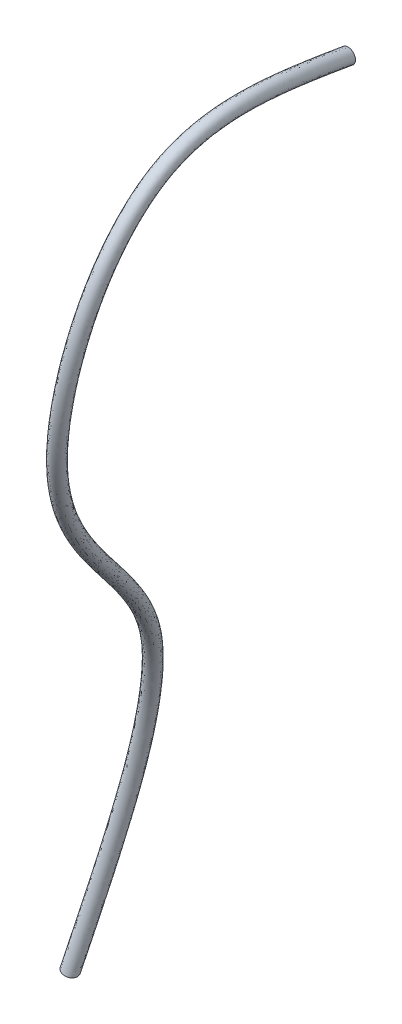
ISO-10303-21;
HEADER;
FILE_DESCRIPTION(('STEP AP214'),'2;1');
FILE_NAME('part.step','',(''),(''),'','','');
FILE_SCHEMA(('AUTOMOTIVE_DESIGN { 1 0 10303 214 1 1 1 1 }'));
ENDSEC;
DATA;
#1=APPLICATION_CONTEXT('core data for automotive mechanical design processes');
#2=APPLICATION_PROTOCOL_DEFINITION('international standard','automotive_design',2000,#1);
#3=PRODUCT_CONTEXT('',#1,'mechanical');
#4=PRODUCT('Part','Part','',(#3));
#5=PRODUCT_RELATED_PRODUCT_CATEGORY('part','',(#4));
#6=PRODUCT_DEFINITION_FORMATION('','',#4);
#7=PRODUCT_DEFINITION_CONTEXT('part definition',#1,'design');
#8=PRODUCT_DEFINITION('design','',#6,#7);
#9=PRODUCT_DEFINITION_SHAPE('','',#8);
#10=(LENGTH_UNIT() NAMED_UNIT(*) SI_UNIT(.MILLI.,.METRE.));
#11=(NAMED_UNIT(*) PLANE_ANGLE_UNIT() SI_UNIT($,.RADIAN.));
#12=(NAMED_UNIT(*) SI_UNIT($,.STERADIAN.) SOLID_ANGLE_UNIT());
#13=UNCERTAINTY_MEASURE_WITH_UNIT(LENGTH_MEASURE(1.E-05),#10,'distance_accuracy_value','');
#14=(GEOMETRIC_REPRESENTATION_CONTEXT(3) GLOBAL_UNCERTAINTY_ASSIGNED_CONTEXT((#13)) GLOBAL_UNIT_ASSIGNED_CONTEXT((#10,
#11,#12)) REPRESENTATION_CONTEXT('',''));
#15=CARTESIAN_POINT('',(0.,0.,0.));
#16=DIRECTION('',(0.,0.,1.));
#17=DIRECTION('',(1.,0.,0.));
#18=AXIS2_PLACEMENT_3D('',#15,#16,#17);
#19=CARTESIAN_POINT('',(-33.945147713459,-110.401100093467,4.85698409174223));
#20=DIRECTION('',(-0.282386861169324,-0.959298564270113,-0.00198121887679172));
#21=DIRECTION('',(0.947950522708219,-0.27872841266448,-0.153948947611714));
#22=AXIS2_PLACEMENT_3D('',#19,#20,#21);
#23=PLANE('',#22);
#24=CARTESIAN_POINT('',(-33.945147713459,-110.401100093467,4.85698409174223));
#25=DIRECTION('',(-0.282386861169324,-0.959298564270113,-0.00198121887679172));
#26=DIRECTION('',(0.947950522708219,-0.27872841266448,-0.153948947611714));
#27=AXIS2_PLACEMENT_3D('',#24,#25,#26);
#28=CIRCLE('',#27,0.609599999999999);
#29=CARTESIAN_POINT('',(-34.5291918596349,-110.229113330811,4.82656783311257));
#30=VERTEX_POINT('',#29);
#31=CARTESIAN_POINT('',(-34.4927669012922,-110.240340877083,5.07118460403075));
#32=VERTEX_POINT('',#31);
#33=EDGE_CURVE('E63',#30,#32,#28,.T.);
#34=ORIENTED_EDGE('',*,*,#33,.T.);
#35=DIRECTION('',(-0.147130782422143,0.0453512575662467,-0.988076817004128));
#36=VECTOR('',#35,1.);
#37=CARTESIAN_POINT('',(-34.4927669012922,-110.240340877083,5.07118460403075));
#38=LINE('',#37,#36);
#39=EDGE_CURVE('E65',#32,#30,#38,.T.);
#40=ORIENTED_EDGE('',*,*,#39,.T.);
#41=EDGE_LOOP('',(#34,#40));
#42=FACE_BOUND('',#41,.T.);
#43=ADVANCED_FACE('F28',(#42),#23,.T.);
#44=CARTESIAN_POINT('',(-16.0909,-39.1414,0.));
#45=DIRECTION('',(0.,0.,1.));
#46=DIRECTION('',(1.,0.,0.));
#47=AXIS2_PLACEMENT_3D('',#44,#45,#46);
#48=PLANE('',#47);
#49=CARTESIAN_POINT('',(-16.0909,-39.1414,0.));
#50=DIRECTION('',(0.,0.,1.));
#51=DIRECTION('',(1.,0.,0.));
#52=AXIS2_PLACEMENT_3D('',#49,#50,#51);
#53=CIRCLE('',#52,0.609599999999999);
#54=CARTESIAN_POINT('',(-16.6878,-39.2651842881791,0.));
#55=VERTEX_POINT('',#54);
#56=CARTESIAN_POINT('',(-16.6878,-39.0176157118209,0.));
#57=VERTEX_POINT('',#56);
#58=EDGE_CURVE('E41',#55,#57,#53,.T.);
#59=ORIENTED_EDGE('',*,*,#58,.F.);
#60=DIRECTION('',(0.,-1.,0.));
#61=VECTOR('',#60,1.);
#62=CARTESIAN_POINT('',(-16.6878,-39.0176157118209,0.));
#63=LINE('',#62,#61);
#64=EDGE_CURVE('E11',#57,#55,#63,.T.);
#65=ORIENTED_EDGE('',*,*,#64,.F.);
#66=EDGE_LOOP('',(#59,#65));
#67=FACE_BOUND('',#66,.T.);
#68=ADVANCED_FACE('F76',(#67),#48,.F.);
#69=CARTESIAN_POINT('',(-16.6878,-39.0176157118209,0.));
#70=CARTESIAN_POINT('',(-16.5432334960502,-38.5356056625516,2.15721072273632));
#71=CARTESIAN_POINT('',(-16.2709485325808,-37.6277598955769,6.22022689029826));
#72=CARTESIAN_POINT('',(-16.0636923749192,-37.3139877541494,11.0989482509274));
#73=CARTESIAN_POINT('',(-16.0897977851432,-38.1311917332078,14.1701498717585));
#74=CARTESIAN_POINT('',(-16.1633068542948,-38.9459790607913,15.7686483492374));
#75=CARTESIAN_POINT('',(-16.3212559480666,-40.316899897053,17.413351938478));
#76=CARTESIAN_POINT('',(-16.5970630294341,-42.3835471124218,18.9587055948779));
#77=CARTESIAN_POINT('',(-17.0826185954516,-45.6417887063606,20.4771899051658));
#78=CARTESIAN_POINT('',(-17.7852105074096,-49.8421586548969,21.4840381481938));
#79=CARTESIAN_POINT('',(-18.7187566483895,-54.7095875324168,21.7156552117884));
#80=CARTESIAN_POINT('',(-19.8153762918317,-59.4050137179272,20.9470887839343));
#81=CARTESIAN_POINT('',(-21.433534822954,-64.9962894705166,18.6543600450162));
#82=CARTESIAN_POINT('',(-23.5881783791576,-70.9435127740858,14.2819441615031));
#83=CARTESIAN_POINT('',(-26.1557593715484,-77.1851674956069,8.5404110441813));
#84=CARTESIAN_POINT('',(-28.7094554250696,-84.0475590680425,3.72580597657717));
#85=CARTESIAN_POINT('',(-30.9463557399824,-92.4387054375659,2.26761173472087));
#86=CARTESIAN_POINT('',(-32.7872262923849,-101.207113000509,3.18264938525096));
#87=CARTESIAN_POINT('',(-33.9133823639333,-107.171687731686,4.42963546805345));
#88=CARTESIAN_POINT('',(-34.4927669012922,-110.240340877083,5.07118460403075));
#89=CARTESIAN_POINT('',(-16.6878,-39.100138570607,0.));
#90=CARTESIAN_POINT('',(-16.5432573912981,-38.6180934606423,2.15627569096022));
#91=CARTESIAN_POINT('',(-16.2710174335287,-37.7101816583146,6.21753076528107));
#92=CARTESIAN_POINT('',(-16.064251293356,-37.3955891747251,11.0776629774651));
#93=CARTESIAN_POINT('',(-16.0893004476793,-38.2009898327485,14.1248953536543));
#94=CARTESIAN_POINT('',(-16.1614176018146,-39.0033221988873,15.7083317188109));
#95=CARTESIAN_POINT('',(-16.3183172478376,-40.3580997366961,17.3410166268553));
#96=CARTESIAN_POINT('',(-16.5930153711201,-42.4085822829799,18.8796010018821));
#97=CARTESIAN_POINT('',(-17.0783032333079,-45.6499077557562,20.3946048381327));
#98=CARTESIAN_POINT('',(-17.7816773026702,-49.835144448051,21.4014269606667));
#99=CARTESIAN_POINT('',(-18.717299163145,-54.6873943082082,21.6355474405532));
#100=CARTESIAN_POINT('',(-19.8111307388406,-59.3656102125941,20.8739455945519));
#101=CARTESIAN_POINT('',(-21.422763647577,-64.9405993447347,18.5931996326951));
#102=CARTESIAN_POINT('',(-23.5789254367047,-70.8783745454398,14.23213119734));
#103=CARTESIAN_POINT('',(-26.1432908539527,-77.1202567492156,8.49060680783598));
#104=CARTESIAN_POINT('',(-28.7088191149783,-83.9965344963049,3.65801443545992));
#105=CARTESIAN_POINT('',(-30.9547391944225,-92.4198991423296,2.18610896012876));
#106=CARTESIAN_POINT('',(-32.798806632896,-101.20084107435,3.10136122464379));
#107=CARTESIAN_POINT('',(-33.9253333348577,-107.167085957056,4.34818173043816));
#108=CARTESIAN_POINT('',(-34.5049085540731,-110.236598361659,4.98964568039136));
#109=CARTESIAN_POINT('',(-16.6878,-39.182661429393,0.));
#110=CARTESIAN_POINT('',(-16.543281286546,-38.7005812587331,2.15534065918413));
#111=CARTESIAN_POINT('',(-16.2710863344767,-37.7926034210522,6.21483464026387));
#112=CARTESIAN_POINT('',(-16.0648102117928,-37.4771905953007,11.0563777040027));
#113=CARTESIAN_POINT('',(-16.0888031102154,-38.2707879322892,14.0796408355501));
#114=CARTESIAN_POINT('',(-16.1595283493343,-39.0606653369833,15.6480150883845));
#115=CARTESIAN_POINT('',(-16.3153785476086,-40.3992995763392,17.2686813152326));
#116=CARTESIAN_POINT('',(-16.5889677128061,-42.4336174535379,18.8004964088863));
#117=CARTESIAN_POINT('',(-17.0739878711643,-45.6580268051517,20.3120197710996));
#118=CARTESIAN_POINT('',(-17.7781440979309,-49.828130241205,21.3188157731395));
#119=CARTESIAN_POINT('',(-18.7158416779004,-54.6652010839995,21.5554396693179));
#120=CARTESIAN_POINT('',(-19.8068851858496,-59.3262067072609,20.8008024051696));
#121=CARTESIAN_POINT('',(-21.4119924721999,-64.8849092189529,18.532039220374));
#122=CARTESIAN_POINT('',(-23.5696724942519,-70.8132363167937,14.182318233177));
#123=CARTESIAN_POINT('',(-26.1308223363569,-77.0553460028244,8.44080257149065));
#124=CARTESIAN_POINT('',(-28.708182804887,-83.9455099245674,3.59022289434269));
#125=CARTESIAN_POINT('',(-30.9631226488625,-92.4010928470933,2.10460618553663));
#126=CARTESIAN_POINT('',(-32.8103869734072,-101.194569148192,3.02007306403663));
#127=CARTESIAN_POINT('',(-33.9372843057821,-107.162484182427,4.26672799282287));
#128=CARTESIAN_POINT('',(-34.517050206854,-110.232855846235,4.90810675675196));
#129=CARTESIAN_POINT('',(-16.6878,-39.2651842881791,0.));
#130=CARTESIAN_POINT('',(-16.543305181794,-38.7830690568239,2.15440562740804));
#131=CARTESIAN_POINT('',(-16.2711552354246,-37.8750251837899,6.21213851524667));
#132=CARTESIAN_POINT('',(-16.0653691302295,-37.5587920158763,11.0350924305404));
#133=CARTESIAN_POINT('',(-16.0883057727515,-38.3405860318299,14.0343863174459));
#134=CARTESIAN_POINT('',(-16.1576390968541,-39.1180084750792,15.587698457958));
#135=CARTESIAN_POINT('',(-16.3124398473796,-40.4404994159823,17.1963460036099));
#136=CARTESIAN_POINT('',(-16.584920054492,-42.4586526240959,18.7213918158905));
#137=CARTESIAN_POINT('',(-17.0696725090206,-45.6661458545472,20.2294347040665));
#138=CARTESIAN_POINT('',(-17.7746108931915,-49.8211160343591,21.2362045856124));
#139=CARTESIAN_POINT('',(-18.7143841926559,-54.6430078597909,21.4753318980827));
#140=CARTESIAN_POINT('',(-19.8026396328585,-59.2868032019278,20.7276592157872));
#141=CARTESIAN_POINT('',(-21.4012212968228,-64.829219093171,18.4708788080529));
#142=CARTESIAN_POINT('',(-23.560419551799,-70.7480980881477,14.132505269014));
#143=CARTESIAN_POINT('',(-26.1183538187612,-76.9904352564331,8.39099833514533));
#144=CARTESIAN_POINT('',(-28.7075464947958,-83.8944853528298,3.52243135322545));
#145=CARTESIAN_POINT('',(-30.9715061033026,-92.3822865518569,2.02310341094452));
#146=CARTESIAN_POINT('',(-32.8219673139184,-101.188297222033,2.93878490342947));
#147=CARTESIAN_POINT('',(-33.9492352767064,-107.157882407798,4.18527425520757));
#148=CARTESIAN_POINT('',(-34.5291918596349,-110.229113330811,4.82656783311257));
#149=B_SPLINE_SURFACE_WITH_KNOTS('',3,3,((#69,#70,#71,#72,#73,#74,#75,#76,#77,#78,#79,#80,#81,
#82,#83,#84,#85,#86,#87,#88),(#89,#90,#91,#92,#93,#94,#95,#96,#97,#98,#99,#100,#101,#102,#103,
#104,#105,#106,#107,#108),(#109,#110,#111,#112,#113,#114,#115,#116,#117,#118,#119,#120,#121,
#122,#123,#124,#125,#126,#127,#128),(#129,#130,#131,#132,#133,#134,#135,#136,#137,#138,#139,
#140,#141,#142,#143,#144,#145,#146,#147,#148)),.UNSPECIFIED.,.F.,.F.,.F.,(4,4),(4,1,1,1,1,1,1,1,
1,1,1,1,1,1,1,1,1,4),(0.797269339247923,1.),(0.,0.0688264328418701,0.129631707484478,
0.147938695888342,0.165870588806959,0.184204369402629,0.213381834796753,0.244927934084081,
0.295578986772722,0.347529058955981,0.397406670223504,0.445106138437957,0.539578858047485,
0.633100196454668,0.721180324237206,0.807774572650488,0.901103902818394,1.),.UNSPECIFIED.);
#150=CARTESIAN_POINT('',(-16.6878,-39.2651842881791,0.));
#151=CARTESIAN_POINT('',(-16.543305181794,-38.7830690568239,2.15440562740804));
#152=CARTESIAN_POINT('',(-16.2711552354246,-37.8750251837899,6.21213851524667));
#153=CARTESIAN_POINT('',(-16.0653691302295,-37.5587920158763,11.0350924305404));
#154=CARTESIAN_POINT('',(-16.0883057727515,-38.3405860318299,14.0343863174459));
#155=CARTESIAN_POINT('',(-16.1576390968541,-39.1180084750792,15.587698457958));
#156=CARTESIAN_POINT('',(-16.3124398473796,-40.4404994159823,17.1963460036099));
#157=CARTESIAN_POINT('',(-16.584920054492,-42.4586526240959,18.7213918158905));
#158=CARTESIAN_POINT('',(-17.0696725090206,-45.6661458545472,20.2294347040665));
#159=CARTESIAN_POINT('',(-17.7746108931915,-49.8211160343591,21.2362045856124));
#160=CARTESIAN_POINT('',(-18.7143841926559,-54.6430078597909,21.4753318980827));
#161=CARTESIAN_POINT('',(-19.8026396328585,-59.2868032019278,20.7276592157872));
#162=CARTESIAN_POINT('',(-21.4012212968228,-64.829219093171,18.4708788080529));
#163=CARTESIAN_POINT('',(-23.560419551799,-70.7480980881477,14.132505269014));
#164=CARTESIAN_POINT('',(-26.1183538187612,-76.9904352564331,8.39099833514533));
#165=CARTESIAN_POINT('',(-28.7075464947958,-83.8944853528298,3.52243135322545));
#166=CARTESIAN_POINT('',(-30.9715061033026,-92.3822865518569,2.02310341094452));
#167=CARTESIAN_POINT('',(-32.8219673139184,-101.188297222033,2.93878490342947));
#168=CARTESIAN_POINT('',(-33.9492352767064,-107.157882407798,4.18527425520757));
#169=CARTESIAN_POINT('',(-34.5291918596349,-110.229113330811,4.82656783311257));
#170=B_SPLINE_CURVE_WITH_KNOTS('',3,(#150,#151,#152,#153,#154,#155,#156,#157,#158,#159,#160,
#161,#162,#163,#164,#165,#166,#167,#168,#169),.UNSPECIFIED.,.F.,.F.,(4,1,1,1,1,1,1,1,1,1,1,1,1,
1,1,1,1,4),(0.,0.0688264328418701,0.129631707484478,0.147938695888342,0.165870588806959,
0.184204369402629,0.213381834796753,0.244927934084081,0.295578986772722,0.347529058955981,
0.397406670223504,0.445106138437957,0.539578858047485,0.633100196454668,0.721180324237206,
0.807774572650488,0.901103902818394,1.),.UNSPECIFIED.);
#171=EDGE_CURVE('E49',#55,#30,#170,.T.);
#172=CARTESIAN_POINT('',(-16.6878,-39.0176157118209,0.));
#173=CARTESIAN_POINT('',(-16.5432334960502,-38.5356056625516,2.15721072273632));
#174=CARTESIAN_POINT('',(-16.2709485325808,-37.6277598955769,6.22022689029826));
#175=CARTESIAN_POINT('',(-16.0636923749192,-37.3139877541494,11.0989482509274));
#176=CARTESIAN_POINT('',(-16.0897977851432,-38.1311917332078,14.1701498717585));
#177=CARTESIAN_POINT('',(-16.1633068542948,-38.9459790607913,15.7686483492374));
#178=CARTESIAN_POINT('',(-16.3212559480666,-40.316899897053,17.413351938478));
#179=CARTESIAN_POINT('',(-16.5970630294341,-42.3835471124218,18.9587055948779));
#180=CARTESIAN_POINT('',(-17.0826185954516,-45.6417887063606,20.4771899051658));
#181=CARTESIAN_POINT('',(-17.7852105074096,-49.8421586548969,21.4840381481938));
#182=CARTESIAN_POINT('',(-18.7187566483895,-54.7095875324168,21.7156552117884));
#183=CARTESIAN_POINT('',(-19.8153762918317,-59.4050137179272,20.9470887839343));
#184=CARTESIAN_POINT('',(-21.433534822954,-64.9962894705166,18.6543600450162));
#185=CARTESIAN_POINT('',(-23.5881783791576,-70.9435127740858,14.2819441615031));
#186=CARTESIAN_POINT('',(-26.1557593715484,-77.1851674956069,8.5404110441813));
#187=CARTESIAN_POINT('',(-28.7094554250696,-84.0475590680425,3.72580597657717));
#188=CARTESIAN_POINT('',(-30.9463557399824,-92.4387054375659,2.26761173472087));
#189=CARTESIAN_POINT('',(-32.7872262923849,-101.207113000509,3.18264938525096));
#190=CARTESIAN_POINT('',(-33.9133823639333,-107.171687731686,4.42963546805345));
#191=CARTESIAN_POINT('',(-34.4927669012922,-110.240340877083,5.07118460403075));
#192=B_SPLINE_CURVE_WITH_KNOTS('',3,(#172,#173,#174,#175,#176,#177,#178,#179,#180,#181,#182,
#183,#184,#185,#186,#187,#188,#189,#190,#191),.UNSPECIFIED.,.F.,.F.,(4,1,1,1,1,1,1,1,1,1,1,1,1,
1,1,1,1,4),(0.,0.0688264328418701,0.129631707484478,0.147938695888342,0.165870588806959,
0.184204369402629,0.213381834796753,0.244927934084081,0.295578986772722,0.347529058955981,
0.397406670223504,0.445106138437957,0.539578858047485,0.633100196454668,0.721180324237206,
0.807774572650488,0.901103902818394,1.),.UNSPECIFIED.);
#193=EDGE_CURVE('E34',#57,#32,#192,.T.);
#194=ORIENTED_EDGE('',*,*,#64,.T.);
#195=ORIENTED_EDGE('',*,*,#171,.T.);
#196=ORIENTED_EDGE('',*,*,#39,.F.);
#197=ORIENTED_EDGE('',*,*,#193,.F.);
#198=EDGE_LOOP('',(#194,#195,#196,#197));
#199=FACE_BOUND('',#198,.T.);
#200=ADVANCED_FACE('F30',(#199),#149,.T.);
#201=CARTESIAN_POINT('',(-16.6878,-39.2651842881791,0.));
#202=CARTESIAN_POINT('',(-16.543305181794,-38.7830690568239,2.15440562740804));
#203=CARTESIAN_POINT('',(-16.2711552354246,-37.8750251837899,6.21213851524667));
#204=CARTESIAN_POINT('',(-16.0653691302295,-37.5587920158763,11.0350924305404));
#205=CARTESIAN_POINT('',(-16.0883057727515,-38.3405860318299,14.0343863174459));
#206=CARTESIAN_POINT('',(-16.1576390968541,-39.1180084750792,15.587698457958));
#207=CARTESIAN_POINT('',(-16.3124398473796,-40.4404994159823,17.1963460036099));
#208=CARTESIAN_POINT('',(-16.584920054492,-42.4586526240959,18.7213918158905));
#209=CARTESIAN_POINT('',(-17.0696725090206,-45.6661458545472,20.2294347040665));
#210=CARTESIAN_POINT('',(-17.7746108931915,-49.8211160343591,21.2362045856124));
#211=CARTESIAN_POINT('',(-18.7143841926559,-54.6430078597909,21.4753318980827));
#212=CARTESIAN_POINT('',(-19.8026396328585,-59.2868032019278,20.7276592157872));
#213=CARTESIAN_POINT('',(-21.4012212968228,-64.829219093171,18.4708788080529));
#214=CARTESIAN_POINT('',(-23.560419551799,-70.7480980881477,14.132505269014));
#215=CARTESIAN_POINT('',(-26.1183538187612,-76.9904352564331,8.39099833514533));
#216=CARTESIAN_POINT('',(-28.7075464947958,-83.8944853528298,3.52243135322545));
#217=CARTESIAN_POINT('',(-30.9715061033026,-92.3822865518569,2.02310341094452));
#218=CARTESIAN_POINT('',(-32.8219673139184,-101.188297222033,2.93878490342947));
#219=CARTESIAN_POINT('',(-33.9492352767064,-107.157882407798,4.18527425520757));
#220=CARTESIAN_POINT('',(-34.5291918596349,-110.229113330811,4.82656783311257));
#221=CARTESIAN_POINT('',(-16.483273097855,-40.2514331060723,0.));
#222=CARTESIAN_POINT('',(-16.3390660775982,-39.7689846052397,2.14358521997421));
#223=CARTESIAN_POINT('',(-16.0674581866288,-38.8603130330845,6.18093832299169));
#224=CARTESIAN_POINT('',(-15.8675782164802,-38.5361192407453,10.7887689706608));
#225=CARTESIAN_POINT('',(-15.8786183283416,-39.1832419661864,13.5097871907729));
#226=CARTESIAN_POINT('',(-15.9320806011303,-39.8178830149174,14.8878241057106));
#227=CARTESIAN_POINT('',(-16.0753639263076,-40.9567266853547,16.3543896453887));
#228=CARTESIAN_POINT('',(-16.3356448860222,-42.7903362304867,17.7970516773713));
#229=CARTESIAN_POINT('',(-16.8183517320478,-45.8050307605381,19.2575529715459));
#230=CARTESIAN_POINT('',(-17.5338210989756,-49.7870051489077,20.2536427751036));
#231=CARTESIAN_POINT('',(-18.5001280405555,-54.432861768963,20.5068645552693));
#232=CARTESIAN_POINT('',(-19.5572779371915,-58.8755056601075,19.8332806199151));
#233=CARTESIAN_POINT('',(-21.0802580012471,-64.2292408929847,17.7150019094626));
#234=CARTESIAN_POINT('',(-23.2583471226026,-70.0288166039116,13.495673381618));
#235=CARTESIAN_POINT('',(-25.7783957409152,-76.2786227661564,7.75997074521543));
#236=CARTESIAN_POINT('',(-28.5082565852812,-83.3428291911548,2.67067076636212));
#237=CARTESIAN_POINT('',(-30.8786016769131,-92.2163426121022,1.01590480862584));
#238=CARTESIAN_POINT('',(-32.7666064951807,-101.170442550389,1.93527170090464));
#239=CARTESIAN_POINT('',(-33.8982238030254,-107.15992533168,3.18013469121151));
#240=CARTESIAN_POINT('',(-34.4804180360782,-110.241393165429,3.82059153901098));
#241=CARTESIAN_POINT('',(-15.4813,-40.1486328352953,0.));
#242=CARTESIAN_POINT('',(-15.3370740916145,-39.6666480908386,2.14648602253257));
#243=CARTESIAN_POINT('',(-15.0654306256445,-38.7588499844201,6.18930266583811));
#244=CARTESIAN_POINT('',(-14.8651843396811,-38.4447092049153,10.8547776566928));
#245=CARTESIAN_POINT('',(-14.8811018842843,-39.1378537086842,13.6457580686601));
#246=CARTESIAN_POINT('',(-14.9400410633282,-39.8177498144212,15.065756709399));
#247=CARTESIAN_POINT('',(-15.0896519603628,-41.0221897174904,16.5549164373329));
#248=CARTESIAN_POINT('',(-15.3564786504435,-42.9182819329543,17.9987478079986));
#249=CARTESIAN_POINT('',(-15.8451713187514,-45.9999505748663,19.4344570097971));
#250=CARTESIAN_POINT('',(-16.565463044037,-50.039307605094,20.3797871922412));
#251=CARTESIAN_POINT('',(-17.5376411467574,-54.7303931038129,20.5523669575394));
#252=CARTESIAN_POINT('',(-18.6091167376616,-59.21668030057,19.8252985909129));
#253=CARTESIAN_POINT('',(-20.1519224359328,-64.6199231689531,17.6690327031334));
#254=CARTESIAN_POINT('',(-22.3317755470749,-70.3999791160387,13.3543882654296));
#255=CARTESIAN_POINT('',(-24.8584968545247,-76.6727735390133,7.64659888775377));
#256=CARTESIAN_POINT('',(-27.5699872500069,-83.691265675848,2.55147436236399));
#257=CARTESIAN_POINT('',(-29.9221803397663,-92.527899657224,0.95507709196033));
#258=CARTESIAN_POINT('',(-31.8029543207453,-101.457999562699,1.87966594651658));
#259=CARTESIAN_POINT('',(-32.9337173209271,-107.44509438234,3.12646201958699));
#260=CARTESIAN_POINT('',(-33.5154720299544,-110.525333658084,3.76791339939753));
#261=CARTESIAN_POINT('',(-15.4813,-38.1341671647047,0.));
#262=CARTESIAN_POINT('',(-15.3364907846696,-37.6530382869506,2.16931108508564));
#263=CARTESIAN_POINT('',(-15.0637486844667,-36.7468521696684,6.25511777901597));
#264=CARTESIAN_POINT('',(-14.8515405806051,-36.4527367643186,11.3743725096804));
#265=CARTESIAN_POINT('',(-14.8932423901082,-37.4340121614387,14.7504662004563));
#266=CARTESIAN_POINT('',(-14.9861596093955,-38.4179463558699,16.5381460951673));
#267=CARTESIAN_POINT('',(-15.16138857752,-40.0164603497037,18.3206938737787));
#268=CARTESIAN_POINT('',(-15.4552860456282,-42.3071483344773,19.9297701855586));
#269=CARTESIAN_POINT('',(-15.9505136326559,-45.8017564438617,21.4504412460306));
#270=CARTESIAN_POINT('',(-16.6517121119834,-50.2105314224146,22.3964090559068));
#271=CARTESIAN_POINT('',(-17.5732198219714,-55.2721519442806,22.5078779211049));
#272=CARTESIAN_POINT('',(-18.7127549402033,-60.1785593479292,21.6107971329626));
#273=CARTESIAN_POINT('',(-20.414857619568,-65.9793749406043,19.162019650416));
#274=CARTESIAN_POINT('',(-22.5576491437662,-71.9900685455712,14.5703726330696));
#275=CARTESIAN_POINT('',(-25.1628658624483,-78.2573098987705,8.86237020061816));
#276=CARTESIAN_POINT('',(-27.5855202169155,-84.9368265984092,4.20633380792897));
#277=CARTESIAN_POINT('',(-29.7175318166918,-92.9869801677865,2.94464148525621));
#278=CARTESIAN_POINT('',(-31.5202666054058,-101.611103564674,3.86399139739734));
#279=CARTESIAN_POINT('',(-32.6419821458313,-107.557428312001,5.11482937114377));
#280=CARTESIAN_POINT('',(-33.2190821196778,-110.61669220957,5.75836022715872));
#281=CARTESIAN_POINT('',(-16.483273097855,-38.0313668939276,0.));
#282=CARTESIAN_POINT('',(-16.3384232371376,-37.5498616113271,2.16873985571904));
#283=CARTESIAN_POINT('',(-16.0656045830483,-36.6429665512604,6.25347066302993));
#284=CARTESIAN_POINT('',(-15.8525419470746,-36.3408419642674,11.3613947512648));
#285=CARTESIAN_POINT('',(-15.8919979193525,-37.3055028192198,14.727244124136));
#286=CARTESIAN_POINT('',(-15.9829061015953,-38.2752127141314,16.5104886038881));
#287=CARTESIAN_POINT('',(-16.1544221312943,-39.8483504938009,18.3003859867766));
#288=CARTESIAN_POINT('',(-16.4445367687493,-42.1168290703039,19.925158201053));
#289=CARTESIAN_POINT('',(-16.9344455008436,-45.5866085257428,21.4792927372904));
#290=CARTESIAN_POINT('',(-17.6288729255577,-49.9757044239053,22.4760852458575));
#291=CARTESIAN_POINT('',(-18.5393379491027,-55.0299136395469,22.6619590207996));
#292=CARTESIAN_POINT('',(-19.6714936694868,-59.935556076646,21.8010108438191));
#293=CARTESIAN_POINT('',(-21.3700288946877,-65.7274411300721,19.3603661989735));
#294=CARTESIAN_POINT('',(-23.5072738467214,-71.7811938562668,14.8357636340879));
#295=CARTESIAN_POINT('',(-26.1138292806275,-78.0248801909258,9.09982619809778));
#296=CARTESIAN_POINT('',(-28.5253748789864,-84.715514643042,4.49442859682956));
#297=CARTESIAN_POINT('',(-30.6530663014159,-92.7222778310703,3.2085282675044));
#298=CARTESIAN_POINT('',(-32.4550670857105,-101.339172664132,4.1221215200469));
#299=CARTESIAN_POINT('',(-33.5767135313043,-107.283724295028,5.37143893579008));
#300=CARTESIAN_POINT('',(-34.1537779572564,-110.34207596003,6.01418749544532));
#301=CARTESIAN_POINT('',(-16.6878,-39.0176157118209,0.));
#302=CARTESIAN_POINT('',(-16.5432334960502,-38.5356056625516,2.15721072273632));
#303=CARTESIAN_POINT('',(-16.2709485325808,-37.6277598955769,6.22022689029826));
#304=CARTESIAN_POINT('',(-16.0636923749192,-37.3139877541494,11.0989482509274));
#305=CARTESIAN_POINT('',(-16.0897977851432,-38.1311917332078,14.1701498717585));
#306=CARTESIAN_POINT('',(-16.1633068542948,-38.9459790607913,15.7686483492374));
#307=CARTESIAN_POINT('',(-16.3212559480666,-40.316899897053,17.413351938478));
#308=CARTESIAN_POINT('',(-16.5970630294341,-42.3835471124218,18.9587055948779));
#309=CARTESIAN_POINT('',(-17.0826185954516,-45.6417887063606,20.4771899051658));
#310=CARTESIAN_POINT('',(-17.7852105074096,-49.8421586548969,21.4840381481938));
#311=CARTESIAN_POINT('',(-18.7187566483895,-54.7095875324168,21.7156552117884));
#312=CARTESIAN_POINT('',(-19.8153762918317,-59.4050137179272,20.9470887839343));
#313=CARTESIAN_POINT('',(-21.433534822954,-64.9962894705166,18.6543600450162));
#314=CARTESIAN_POINT('',(-23.5881783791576,-70.9435127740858,14.2819441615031));
#315=CARTESIAN_POINT('',(-26.1557593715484,-77.1851674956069,8.5404110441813));
#316=CARTESIAN_POINT('',(-28.7094554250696,-84.0475590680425,3.72580597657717));
#317=CARTESIAN_POINT('',(-30.9463557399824,-92.4387054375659,2.26761173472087));
#318=CARTESIAN_POINT('',(-32.7872262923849,-101.207113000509,3.18264938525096));
#319=CARTESIAN_POINT('',(-33.9133823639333,-107.171687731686,4.42963546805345));
#320=CARTESIAN_POINT('',(-34.4927669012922,-110.240340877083,5.07118460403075));
#321=(BOUNDED_SURFACE() B_SPLINE_SURFACE(3,3,((#201,#202,#203,#204,#205,#206,#207,#208,#209,
#210,#211,#212,#213,#214,#215,#216,#217,#218,#219,#220),(#221,#222,#223,#224,#225,#226,#227,
#228,#229,#230,#231,#232,#233,#234,#235,#236,#237,#238,#239,#240),(#241,#242,#243,#244,#245,
#246,#247,#248,#249,#250,#251,#252,#253,#254,#255,#256,#257,#258,#259,#260),(#261,#262,#263,
#264,#265,#266,#267,#268,#269,#270,#271,#272,#273,#274,#275,#276,#277,#278,#279,#280),(#281,
#282,#283,#284,#285,#286,#287,#288,#289,#290,#291,#292,#293,#294,#295,#296,#297,#298,#299,#300),
(#301,#302,#303,#304,#305,#306,#307,#308,#309,#310,#311,#312,#313,#314,#315,#316,#317,#318,#319,
#320)),.UNSPECIFIED.,.F.,.F.,.F.) B_SPLINE_SURFACE_WITH_KNOTS((4,2,4),(4,1,1,1,1,1,1,1,1,1,1,1,
1,1,1,1,1,4),(0.,0.398634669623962,0.797269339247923),(0.,0.0688264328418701,0.129631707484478,
0.147938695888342,0.165870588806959,0.184204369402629,0.213381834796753,0.244927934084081,
0.295578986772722,0.347529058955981,0.397406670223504,0.445106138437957,0.539578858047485,
0.633100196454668,0.721180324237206,0.807774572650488,0.901103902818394,1.),
.UNSPECIFIED.) GEOMETRIC_REPRESENTATION_ITEM() RATIONAL_B_SPLINE_SURFACE(((1.,1.,1.,1.,1.,1.,1.,
1.,1.,1.,1.,1.,1.,1.,1.,1.,1.,1.,1.,1.),(0.161101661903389,0.161101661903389,0.161101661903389,
0.161101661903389,0.161101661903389,0.161101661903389,0.161101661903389,0.161101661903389,
0.161101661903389,0.161101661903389,0.161101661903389,0.161101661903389,0.161101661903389,
0.161101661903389,0.161101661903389,0.161101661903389,0.161101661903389,0.161101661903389,
0.161101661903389,0.161101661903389),(0.0646621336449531,0.0646621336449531,0.0646621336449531,
0.0646621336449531,0.0646621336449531,0.0646621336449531,0.0646621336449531,0.0646621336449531,
0.0646621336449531,0.0646621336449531,0.0646621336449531,0.0646621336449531,0.0646621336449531,
0.0646621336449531,0.0646621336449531,0.0646621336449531,0.0646621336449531,0.0646621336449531,
0.0646621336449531,0.0646621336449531),(0.0646621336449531,0.0646621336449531,
0.0646621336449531,0.0646621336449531,0.0646621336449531,0.0646621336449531,0.0646621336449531,
0.0646621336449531,0.0646621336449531,0.0646621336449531,0.0646621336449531,0.0646621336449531,
0.0646621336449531,0.0646621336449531,0.0646621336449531,0.0646621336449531,0.0646621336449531,
0.0646621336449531,0.0646621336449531,0.0646621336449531),(0.161101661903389,0.161101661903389,
0.161101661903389,0.161101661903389,0.161101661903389,0.161101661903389,0.161101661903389,
0.161101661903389,0.161101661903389,0.161101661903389,0.161101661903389,0.161101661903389,
0.161101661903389,0.161101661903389,0.161101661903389,0.161101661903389,0.161101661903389,
0.161101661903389,0.161101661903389,0.161101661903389),(1.,1.,1.,1.,1.,1.,1.,1.,1.,1.,1.,1.,1.,
1.,1.,1.,1.,1.,1.,1.))) REPRESENTATION_ITEM('') SURFACE());
#322=ORIENTED_EDGE('',*,*,#58,.T.);
#323=ORIENTED_EDGE('',*,*,#193,.T.);
#324=ORIENTED_EDGE('',*,*,#33,.F.);
#325=ORIENTED_EDGE('',*,*,#171,.F.);
#326=EDGE_LOOP('',(#322,#323,#324,#325));
#327=FACE_BOUND('',#326,.T.);
#328=ADVANCED_FACE('F61',(#327),#321,.T.);
#329=CLOSED_SHELL('',(#43,#68,#200,#328));
#330=MANIFOLD_SOLID_BREP('B2',#329);
#331=ADVANCED_BREP_SHAPE_REPRESENTATION('',(#18,#330),#14);
#332=SHAPE_DEFINITION_REPRESENTATION(#9,#331);
ENDSEC;
END-ISO-10303-21;
